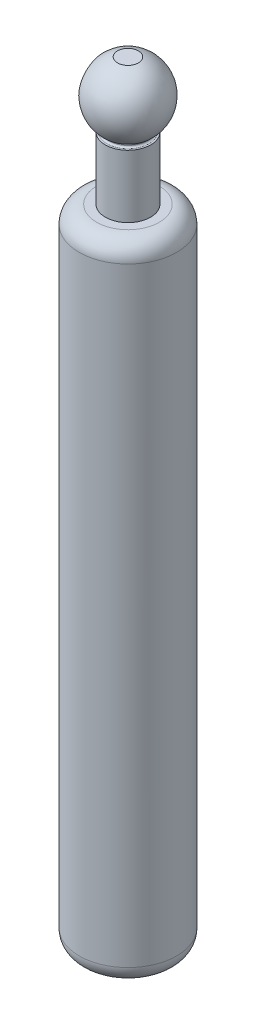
ISO-10303-21;
HEADER;
FILE_DESCRIPTION(('STEP AP214'),'2;1');
FILE_NAME('part.step','',(''),(''),'','','');
FILE_SCHEMA(('AUTOMOTIVE_DESIGN { 1 0 10303 214 1 1 1 1 }'));
ENDSEC;
DATA;
#1=APPLICATION_CONTEXT('core data for automotive mechanical design processes');
#2=APPLICATION_PROTOCOL_DEFINITION('international standard','automotive_design',2000,#1);
#3=PRODUCT_CONTEXT('',#1,'mechanical');
#4=PRODUCT('Part','Part','',(#3));
#5=PRODUCT_RELATED_PRODUCT_CATEGORY('part','',(#4));
#6=PRODUCT_DEFINITION_FORMATION('','',#4);
#7=PRODUCT_DEFINITION_CONTEXT('part definition',#1,'design');
#8=PRODUCT_DEFINITION('design','',#6,#7);
#9=PRODUCT_DEFINITION_SHAPE('','',#8);
#10=(LENGTH_UNIT() NAMED_UNIT(*) SI_UNIT(.MILLI.,.METRE.));
#11=(NAMED_UNIT(*) PLANE_ANGLE_UNIT() SI_UNIT($,.RADIAN.));
#12=(NAMED_UNIT(*) SI_UNIT($,.STERADIAN.) SOLID_ANGLE_UNIT());
#13=UNCERTAINTY_MEASURE_WITH_UNIT(LENGTH_MEASURE(1.E-05),#10,'distance_accuracy_value','');
#14=(GEOMETRIC_REPRESENTATION_CONTEXT(3) GLOBAL_UNCERTAINTY_ASSIGNED_CONTEXT((#13)) GLOBAL_UNIT_ASSIGNED_CONTEXT((#10,
#11,#12)) REPRESENTATION_CONTEXT('',''));
#15=CARTESIAN_POINT('',(0.,0.,0.));
#16=DIRECTION('',(0.,0.,1.));
#17=DIRECTION('',(1.,0.,0.));
#18=AXIS2_PLACEMENT_3D('',#15,#16,#17);
#19=CARTESIAN_POINT('',(-2.,0.,0.));
#20=DIRECTION('',(-1.,0.,0.));
#21=DIRECTION('',(0.,0.,0.999999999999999));
#22=AXIS2_PLACEMENT_3D('',#19,#20,#21);
#23=PLANE('',#22);
#24=CARTESIAN_POINT('',(-2.,0.,0.));
#25=DIRECTION('',(-1.,0.,0.));
#26=DIRECTION('',(0.,0.,0.999999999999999));
#27=AXIS2_PLACEMENT_3D('',#24,#25,#26);
#28=CIRCLE('',#27,6.5);
#29=CARTESIAN_POINT('',(-2.,0.,6.5));
#30=VERTEX_POINT('',#29);
#31=EDGE_CURVE('E88',#30,#30,#28,.T.);
#32=ORIENTED_EDGE('',*,*,#31,.T.);
#33=EDGE_LOOP('',(#32));
#34=FACE_BOUND('',#33,.T.);
#35=CARTESIAN_POINT('',(-2.,0.,0.));
#36=DIRECTION('',(-1.,0.,0.));
#37=DIRECTION('',(0.,0.,0.999999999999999));
#38=AXIS2_PLACEMENT_3D('',#35,#36,#37);
#39=CIRCLE('',#38,6.18465843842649);
#40=CARTESIAN_POINT('',(-2.,0.,6.18465843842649));
#41=VERTEX_POINT('',#40);
#42=EDGE_CURVE('E52',#41,#41,#39,.F.);
#43=ORIENTED_EDGE('',*,*,#42,.T.);
#44=EDGE_LOOP('',(#43));
#45=FACE_BOUND('',#44,.T.);
#46=ADVANCED_FACE('F31',(#34,#45),#23,.T.);
#47=CARTESIAN_POINT('',(0.,0.,0.));
#48=DIRECTION('',(0.,0.999999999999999,0.));
#49=DIRECTION('',(0.999999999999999,0.,0.));
#50=AXIS2_PLACEMENT_3D('',#47,#48,#49);
#51=SPHERICAL_SURFACE('',#50,10.);
#52=CARTESIAN_POINT('',(-1.66533453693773E-13,-7.59934207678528,0.));
#53=DIRECTION('',(0.,0.999999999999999,0.));
#54=DIRECTION('',(0.,0.,1.));
#55=AXIS2_PLACEMENT_3D('',#52,#53,#54);
#56=CIRCLE('',#55,6.50000000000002);
#57=CARTESIAN_POINT('',(-1.65450986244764E-13,-7.59934207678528,6.50000000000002));
#58=VERTEX_POINT('',#57);
#59=EDGE_CURVE('E67',#58,#58,#56,.T.);
#60=ORIENTED_EDGE('',*,*,#59,.T.);
#61=EDGE_LOOP('',(#60));
#62=FACE_BOUND('',#61,.T.);
#63=CARTESIAN_POINT('',(1.66533453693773E-13,9.5393920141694,0.));
#64=DIRECTION('',(0.,0.999999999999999,0.));
#65=DIRECTION('',(0.,0.,1.));
#66=AXIS2_PLACEMENT_3D('',#63,#64,#65);
#67=CIRCLE('',#66,3.00000000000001);
#68=CARTESIAN_POINT('',(1.67033054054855E-13,9.5393920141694,3.00000000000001));
#69=VERTEX_POINT('',#68);
#70=EDGE_CURVE('E70',#69,#69,#67,.T.);
#71=ORIENTED_EDGE('',*,*,#70,.F.);
#72=EDGE_LOOP('',(#71));
#73=FACE_BOUND('',#72,.T.);
#74=CARTESIAN_POINT('',(-6.99999999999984,0.,0.));
#75=DIRECTION('',(-1.,0.,0.));
#76=DIRECTION('',(0.,0.,0.999999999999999));
#77=AXIS2_PLACEMENT_3D('',#74,#75,#76);
#78=CIRCLE('',#77,7.14142842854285);
#79=CARTESIAN_POINT('',(-6.99999999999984,0.,7.14142842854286));
#80=VERTEX_POINT('',#79);
#81=EDGE_CURVE('E85',#80,#80,#78,.F.);
#82=ORIENTED_EDGE('',*,*,#81,.T.);
#83=EDGE_LOOP('',(#82));
#84=FACE_BOUND('',#83,.T.);
#85=ADVANCED_FACE('F103',(#62,#73,#84),#51,.T.);
#86=CARTESIAN_POINT('',(-1.11022302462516E-13,88.2813261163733,0.));
#87=DIRECTION('',(0.,0.999999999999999,0.));
#88=DIRECTION('',(0.,0.,1.));
#89=AXIS2_PLACEMENT_3D('',#86,#87,#88);
#90=CYLINDRICAL_SURFACE('',#89,5.50000000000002);
#91=CARTESIAN_POINT('',(0.,-8.09934207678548,0.));
#92=DIRECTION('',(0.,0.999999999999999,0.));
#93=DIRECTION('',(0.,0.,1.));
#94=AXIS2_PLACEMENT_3D('',#91,#92,#93);
#95=CIRCLE('',#94,5.50000000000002);
#96=CARTESIAN_POINT('',(-1.12614275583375E-13,-8.09934207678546,5.49999999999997));
#97=VERTEX_POINT('',#96);
#98=EDGE_CURVE('E58',#97,#97,#95,.F.);
#99=CARTESIAN_POINT('',(0.,-8.59934207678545,0.));
#100=DIRECTION('',(0.,-0.999999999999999,0.));
#101=DIRECTION('',(0.,0.,-1.));
#102=AXIS2_PLACEMENT_3D('',#99,#100,#101);
#103=CIRCLE('',#102,5.50000000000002);
#104=CARTESIAN_POINT('',(-1.12627286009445E-13,-8.59934207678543,5.49999999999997));
#105=VERTEX_POINT('',#104);
#106=EDGE_CURVE('E61',#105,#105,#103,.F.);
#107=CARTESIAN_POINT('',(-1.12614275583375E-13,-8.09934207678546,5.49999999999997));
#108=CARTESIAN_POINT('',(-1.12614411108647E-13,-8.1045504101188,5.49999999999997));
#109=CARTESIAN_POINT('',(-1.12614546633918E-13,-8.10975874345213,5.49999999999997));
#110=CARTESIAN_POINT('',(-1.12614817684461E-13,-8.1201754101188,5.49999999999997));
#111=CARTESIAN_POINT('',(-1.12614953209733E-13,-8.12538374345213,5.49999999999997));
#112=CARTESIAN_POINT('',(-1.12615224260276E-13,-8.13580041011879,5.49999999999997));
#113=CARTESIAN_POINT('',(-1.12615359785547E-13,-8.14100874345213,5.49999999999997));
#114=CARTESIAN_POINT('',(-1.12615630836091E-13,-8.1514254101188,5.49999999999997));
#115=CARTESIAN_POINT('',(-1.12615766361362E-13,-8.15663374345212,5.49999999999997));
#116=CARTESIAN_POINT('',(-1.12616037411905E-13,-8.16705041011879,5.49999999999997));
#117=CARTESIAN_POINT('',(-1.12616172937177E-13,-8.17225874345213,5.49999999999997));
#118=CARTESIAN_POINT('',(-1.1261644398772E-13,-8.18267541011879,5.49999999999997));
#119=CARTESIAN_POINT('',(-1.12616579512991E-13,-8.18788374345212,5.49999999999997));
#120=CARTESIAN_POINT('',(-1.12616850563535E-13,-8.19830041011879,5.49999999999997));
#121=CARTESIAN_POINT('',(-1.12616986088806E-13,-8.20350874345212,5.49999999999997));
#122=CARTESIAN_POINT('',(-1.12617257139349E-13,-8.21392541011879,5.49999999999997));
#123=CARTESIAN_POINT('',(-1.12617392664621E-13,-8.21913374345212,5.49999999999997));
#124=CARTESIAN_POINT('',(-1.12617663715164E-13,-8.22955041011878,5.49999999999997));
#125=CARTESIAN_POINT('',(-1.12617799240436E-13,-8.23475874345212,5.49999999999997));
#126=CARTESIAN_POINT('',(-1.12618070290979E-13,-8.24517541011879,5.49999999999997));
#127=CARTESIAN_POINT('',(-1.1261820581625E-13,-8.25038374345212,5.49999999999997));
#128=CARTESIAN_POINT('',(-1.12618476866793E-13,-8.26080041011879,5.49999999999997));
#129=CARTESIAN_POINT('',(-1.12618612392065E-13,-8.26600874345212,5.49999999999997));
#130=CARTESIAN_POINT('',(-1.12618883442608E-13,-8.27642541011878,5.49999999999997));
#131=CARTESIAN_POINT('',(-1.1261901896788E-13,-8.28163374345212,5.49999999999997));
#132=CARTESIAN_POINT('',(-1.12619290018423E-13,-8.29205041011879,5.49999999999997));
#133=CARTESIAN_POINT('',(-1.12619425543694E-13,-8.29725874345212,5.49999999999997));
#134=CARTESIAN_POINT('',(-1.12619696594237E-13,-8.30767541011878,5.49999999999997));
#135=CARTESIAN_POINT('',(-1.12619832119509E-13,-8.31288374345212,5.49999999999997));
#136=CARTESIAN_POINT('',(-1.12620103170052E-13,-8.32330041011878,5.49999999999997));
#137=CARTESIAN_POINT('',(-1.12620238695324E-13,-8.32850874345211,5.49999999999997));
#138=CARTESIAN_POINT('',(-1.12620509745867E-13,-8.33892541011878,5.49999999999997));
#139=CARTESIAN_POINT('',(-1.12620645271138E-13,-8.34413374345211,5.49999999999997));
#140=CARTESIAN_POINT('',(-1.12620916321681E-13,-8.35455041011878,5.49999999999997));
#141=CARTESIAN_POINT('',(-1.12621051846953E-13,-8.35975874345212,5.49999999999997));
#142=CARTESIAN_POINT('',(-1.12621322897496E-13,-8.37017541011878,5.49999999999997));
#143=CARTESIAN_POINT('',(-1.12621458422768E-13,-8.37538374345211,5.49999999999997));
#144=CARTESIAN_POINT('',(-1.12621729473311E-13,-8.38580041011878,5.49999999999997));
#145=CARTESIAN_POINT('',(-1.12621864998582E-13,-8.39100874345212,5.49999999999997));
#146=CARTESIAN_POINT('',(-1.12622136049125E-13,-8.40142541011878,5.49999999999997));
#147=CARTESIAN_POINT('',(-1.12622271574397E-13,-8.40663374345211,5.49999999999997));
#148=CARTESIAN_POINT('',(-1.1262254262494E-13,-8.41705041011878,5.49999999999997));
#149=CARTESIAN_POINT('',(-1.12622678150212E-13,-8.42225874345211,5.49999999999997));
#150=CARTESIAN_POINT('',(-1.12622949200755E-13,-8.43267541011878,5.49999999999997));
#151=CARTESIAN_POINT('',(-1.12623084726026E-13,-8.43788374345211,5.49999999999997));
#152=CARTESIAN_POINT('',(-1.1262335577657E-13,-8.44830041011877,5.49999999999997));
#153=CARTESIAN_POINT('',(-1.12623491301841E-13,-8.45350874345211,5.49999999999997));
#154=CARTESIAN_POINT('',(-1.12623762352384E-13,-8.46392541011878,5.49999999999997));
#155=CARTESIAN_POINT('',(-1.12623897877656E-13,-8.46913374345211,5.49999999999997));
#156=CARTESIAN_POINT('',(-1.12624168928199E-13,-8.47955041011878,5.49999999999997));
#157=CARTESIAN_POINT('',(-1.1262430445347E-13,-8.48475874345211,5.49999999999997));
#158=CARTESIAN_POINT('',(-1.12624575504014E-13,-8.49517541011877,5.49999999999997));
#159=CARTESIAN_POINT('',(-1.12624711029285E-13,-8.50038374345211,5.49999999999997));
#160=CARTESIAN_POINT('',(-1.12624982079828E-13,-8.51080041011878,5.49999999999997));
#161=CARTESIAN_POINT('',(-1.126251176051E-13,-8.51600874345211,5.49999999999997));
#162=CARTESIAN_POINT('',(-1.12625388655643E-13,-8.52642541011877,5.49999999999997));
#163=CARTESIAN_POINT('',(-1.12625524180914E-13,-8.53163374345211,5.49999999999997));
#164=CARTESIAN_POINT('',(-1.12625795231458E-13,-8.54205041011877,5.49999999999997));
#165=CARTESIAN_POINT('',(-1.12625930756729E-13,-8.5472587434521,5.49999999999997));
#166=CARTESIAN_POINT('',(-1.12626201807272E-13,-8.55767541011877,5.49999999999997));
#167=CARTESIAN_POINT('',(-1.12626337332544E-13,-8.5628837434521,5.49999999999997));
#168=CARTESIAN_POINT('',(-1.12626608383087E-13,-8.57330041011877,5.49999999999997));
#169=CARTESIAN_POINT('',(-1.12626743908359E-13,-8.5785087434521,5.49999999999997));
#170=CARTESIAN_POINT('',(-1.12627014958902E-13,-8.58892541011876,5.49999999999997));
#171=CARTESIAN_POINT('',(-1.12627150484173E-13,-8.5941337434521,5.49999999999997));
#172=CARTESIAN_POINT('',(-1.12627286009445E-13,-8.59934207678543,5.49999999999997));
#173=B_SPLINE_CURVE_WITH_KNOTS('',3,(#107,#108,#109,#110,#111,#112,#113,#114,#115,#116,#117,
#118,#119,#120,#121,#122,#123,#124,#125,#126,#127,#128,#129,#130,#131,#132,#133,#134,#135,#136,
#137,#138,#139,#140,#141,#142,#143,#144,#145,#146,#147,#148,#149,#150,#151,#152,#153,#154,#155,
#156,#157,#158,#159,#160,#161,#162,#163,#164,#165,#166,#167,#168,#169,#170,#171,#172),
.UNSPECIFIED.,.F.,.F.,(4,2,2,2,2,2,2,2,2,2,2,2,2,2,2,2,2,2,2,2,2,2,2,2,2,2,2,2,2,2,2,2,4),(0.,
0.0156250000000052,0.0312499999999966,0.0468750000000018,0.0624999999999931,0.0781249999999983,
0.0937499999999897,0.109374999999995,0.124999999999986,0.140624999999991,0.156249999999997,
0.171874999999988,0.187499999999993,0.203124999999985,0.21874999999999,0.234374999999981,
0.249999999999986,0.265624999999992,0.281249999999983,0.296874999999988,0.312499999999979,
0.328124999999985,0.343749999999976,0.359374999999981,0.374999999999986,0.390624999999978,
0.406249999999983,0.421874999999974,0.43749999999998,0.453124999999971,0.468749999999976,
0.484374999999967,0.499999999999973),.UNSPECIFIED.);
#174=EDGE_CURVE('BSEAM33',#97,#105,#173,.T.);
#175=ORIENTED_EDGE('',*,*,#98,.T.);
#176=ORIENTED_EDGE('',*,*,#106,.T.);
#177=ORIENTED_EDGE('',*,*,#174,.T.);
#178=ORIENTED_EDGE('',*,*,#174,.F.);
#179=EDGE_LOOP('',(#175,#177,#176,#178));
#180=FACE_BOUND('',#179,.T.);
#181=ADVANCED_FACE('F33',(#180),#90,.T.);
#182=CARTESIAN_POINT('',(6.50000000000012,-7.59934207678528,-1.11022302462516E-13));
#183=DIRECTION('',(0.,0.999999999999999,0.));
#184=DIRECTION('',(0.,0.,1.));
#185=AXIS2_PLACEMENT_3D('',#182,#183,#184);
#186=PLANE('',#185);
#187=CARTESIAN_POINT('',(-1.66533453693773E-13,-7.59934207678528,0.));
#188=DIRECTION('',(0.,0.999999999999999,0.));
#189=DIRECTION('',(0.,0.,1.));
#190=AXIS2_PLACEMENT_3D('',#187,#188,#189);
#191=CIRCLE('',#190,6.00000000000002);
#192=CARTESIAN_POINT('',(-1.65534252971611E-13,-7.59934207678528,6.00000000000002));
#193=VERTEX_POINT('',#192);
#194=EDGE_CURVE('E64',#193,#193,#191,.T.);
#195=ORIENTED_EDGE('',*,*,#194,.T.);
#196=EDGE_LOOP('',(#195));
#197=FACE_BOUND('',#196,.T.);
#198=ORIENTED_EDGE('',*,*,#59,.F.);
#199=EDGE_LOOP('',(#198));
#200=FACE_BOUND('',#199,.T.);
#201=ADVANCED_FACE('F111',(#197,#200),#186,.F.);
#202=CARTESIAN_POINT('',(1.66533453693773E-13,9.5393920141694,0.));
#203=DIRECTION('',(0.,-0.999999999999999,0.));
#204=DIRECTION('',(0.,0.,-1.));
#205=AXIS2_PLACEMENT_3D('',#202,#203,#204);
#206=PLANE('',#205);
#207=ORIENTED_EDGE('',*,*,#70,.T.);
#208=EDGE_LOOP('',(#207));
#209=FACE_BOUND('',#208,.T.);
#210=ADVANCED_FACE('F117',(#209),#206,.F.);
#211=CARTESIAN_POINT('',(2.22044604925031E-13,-52.0993420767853,-1.56125112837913E-13));
#212=DIRECTION('',(0.,0.999999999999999,0.));
#213=DIRECTION('',(0.,0.,1.));
#214=AXIS2_PLACEMENT_3D('',#211,#212,#213);
#215=PLANE('',#214);
#216=CARTESIAN_POINT('',(2.22044604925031E-13,-52.0993420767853,-1.56125112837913E-13));
#217=DIRECTION('',(0.,0.999999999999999,0.));
#218=DIRECTION('',(0.,0.,1.));
#219=AXIS2_PLACEMENT_3D('',#216,#217,#218);
#220=CIRCLE('',#219,7.00000000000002);
#221=CARTESIAN_POINT('',(-1.13509392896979E-13,-52.0993420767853,6.99999999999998));
#222=VERTEX_POINT('',#221);
#223=EDGE_CURVE('E73',#222,#222,#220,.T.);
#224=ORIENTED_EDGE('',*,*,#223,.F.);
#225=EDGE_LOOP('',(#224));
#226=FACE_BOUND('',#225,.T.);
#227=ADVANCED_FACE('F124',(#226),#215,.F.);
#228=CARTESIAN_POINT('',(-1.11022302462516E-13,88.2813261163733,0.));
#229=DIRECTION('',(0.,0.999999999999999,0.));
#230=DIRECTION('',(0.,0.,1.));
#231=AXIS2_PLACEMENT_3D('',#228,#229,#230);
#232=CYLINDRICAL_SURFACE('',#231,7.00000000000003);
#233=CARTESIAN_POINT('',(2.22044604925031E-13,-212.099342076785,-1.73472347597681E-13));
#234=DIRECTION('',(0.,0.999999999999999,0.));
#235=DIRECTION('',(0.,0.,1.));
#236=AXIS2_PLACEMENT_3D('',#233,#234,#235);
#237=CIRCLE('',#236,7.00000000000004);
#238=CARTESIAN_POINT('',(-1.17672729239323E-13,-212.099342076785,6.99999999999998));
#239=VERTEX_POINT('',#238);
#240=EDGE_CURVE('E76',#239,#239,#237,.T.);
#241=CARTESIAN_POINT('',(-1.17672729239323E-13,-212.099342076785,6.99999999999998));
#242=CARTESIAN_POINT('',(-1.17629361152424E-13,-210.432675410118,6.99999999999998));
#243=CARTESIAN_POINT('',(-1.17585993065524E-13,-208.766008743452,6.99999999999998));
#244=CARTESIAN_POINT('',(-1.17499256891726E-13,-205.432675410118,6.99999999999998));
#245=CARTESIAN_POINT('',(-1.17455888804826E-13,-203.766008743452,6.99999999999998));
#246=CARTESIAN_POINT('',(-1.17369152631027E-13,-200.432675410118,6.99999999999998));
#247=CARTESIAN_POINT('',(-1.17325784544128E-13,-198.766008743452,6.99999999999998));
#248=CARTESIAN_POINT('',(-1.17239048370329E-13,-195.432675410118,6.99999999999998));
#249=CARTESIAN_POINT('',(-1.1719568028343E-13,-193.766008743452,6.99999999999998));
#250=CARTESIAN_POINT('',(-1.17108944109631E-13,-190.432675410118,6.99999999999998));
#251=CARTESIAN_POINT('',(-1.17065576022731E-13,-188.766008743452,6.99999999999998));
#252=CARTESIAN_POINT('',(-1.16978839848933E-13,-185.432675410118,6.99999999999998));
#253=CARTESIAN_POINT('',(-1.16935471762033E-13,-183.766008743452,6.99999999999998));
#254=CARTESIAN_POINT('',(-1.16848735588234E-13,-180.432675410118,6.99999999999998));
#255=CARTESIAN_POINT('',(-1.16805367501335E-13,-178.766008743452,6.99999999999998));
#256=CARTESIAN_POINT('',(-1.16718631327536E-13,-175.432675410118,6.99999999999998));
#257=CARTESIAN_POINT('',(-1.16675263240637E-13,-173.766008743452,6.99999999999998));
#258=CARTESIAN_POINT('',(-1.16588527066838E-13,-170.432675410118,6.99999999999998));
#259=CARTESIAN_POINT('',(-1.16545158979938E-13,-168.766008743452,6.99999999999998));
#260=CARTESIAN_POINT('',(-1.1645842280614E-13,-165.432675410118,6.99999999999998));
#261=CARTESIAN_POINT('',(-1.1641505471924E-13,-163.766008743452,6.99999999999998));
#262=CARTESIAN_POINT('',(-1.16328318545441E-13,-160.432675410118,6.99999999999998));
#263=CARTESIAN_POINT('',(-1.16284950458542E-13,-158.766008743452,6.99999999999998));
#264=CARTESIAN_POINT('',(-1.16198214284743E-13,-155.432675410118,6.99999999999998));
#265=CARTESIAN_POINT('',(-1.16154846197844E-13,-153.766008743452,6.99999999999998));
#266=CARTESIAN_POINT('',(-1.16068110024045E-13,-150.432675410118,6.99999999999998));
#267=CARTESIAN_POINT('',(-1.16024741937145E-13,-148.766008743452,6.99999999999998));
#268=CARTESIAN_POINT('',(-1.15938005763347E-13,-145.432675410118,6.99999999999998));
#269=CARTESIAN_POINT('',(-1.15894637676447E-13,-143.766008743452,6.99999999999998));
#270=CARTESIAN_POINT('',(-1.15807901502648E-13,-140.432675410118,6.99999999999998));
#271=CARTESIAN_POINT('',(-1.15764533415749E-13,-138.766008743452,6.99999999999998));
#272=CARTESIAN_POINT('',(-1.1567779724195E-13,-135.432675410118,6.99999999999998));
#273=CARTESIAN_POINT('',(-1.15634429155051E-13,-133.766008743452,6.99999999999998));
#274=CARTESIAN_POINT('',(-1.15547692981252E-13,-130.432675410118,6.99999999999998));
#275=CARTESIAN_POINT('',(-1.15504324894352E-13,-128.766008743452,6.99999999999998));
#276=CARTESIAN_POINT('',(-1.15417588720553E-13,-125.432675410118,6.99999999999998));
#277=CARTESIAN_POINT('',(-1.15374220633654E-13,-123.766008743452,6.99999999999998));
#278=CARTESIAN_POINT('',(-1.15287484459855E-13,-120.432675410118,6.99999999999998));
#279=CARTESIAN_POINT('',(-1.15244116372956E-13,-118.766008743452,6.99999999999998));
#280=CARTESIAN_POINT('',(-1.15157380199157E-13,-115.432675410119,6.99999999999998));
#281=CARTESIAN_POINT('',(-1.15114012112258E-13,-113.766008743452,6.99999999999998));
#282=CARTESIAN_POINT('',(-1.15027275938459E-13,-110.432675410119,6.99999999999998));
#283=CARTESIAN_POINT('',(-1.14983907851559E-13,-108.766008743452,6.99999999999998));
#284=CARTESIAN_POINT('',(-1.1489717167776E-13,-105.432675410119,6.99999999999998));
#285=CARTESIAN_POINT('',(-1.14853803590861E-13,-103.766008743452,6.99999999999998));
#286=CARTESIAN_POINT('',(-1.14767067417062E-13,-100.432675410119,6.99999999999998));
#287=CARTESIAN_POINT('',(-1.14723699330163E-13,-98.7660087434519,6.99999999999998));
#288=CARTESIAN_POINT('',(-1.14636963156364E-13,-95.4326754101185,6.99999999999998));
#289=CARTESIAN_POINT('',(-1.14593595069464E-13,-93.7660087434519,6.99999999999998));
#290=CARTESIAN_POINT('',(-1.14506858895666E-13,-90.4326754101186,6.99999999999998));
#291=CARTESIAN_POINT('',(-1.14463490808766E-13,-88.7660087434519,6.99999999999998));
#292=CARTESIAN_POINT('',(-1.14376754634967E-13,-85.4326754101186,6.99999999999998));
#293=CARTESIAN_POINT('',(-1.14333386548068E-13,-83.7660087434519,6.99999999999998));
#294=CARTESIAN_POINT('',(-1.14246650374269E-13,-80.4326754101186,6.99999999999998));
#295=CARTESIAN_POINT('',(-1.1420328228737E-13,-78.7660087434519,6.99999999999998));
#296=CARTESIAN_POINT('',(-1.14116546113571E-13,-75.4326754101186,6.99999999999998));
#297=CARTESIAN_POINT('',(-1.14073178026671E-13,-73.7660087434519,6.99999999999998));
#298=CARTESIAN_POINT('',(-1.13986441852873E-13,-70.4326754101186,6.99999999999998));
#299=CARTESIAN_POINT('',(-1.13943073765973E-13,-68.7660087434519,6.99999999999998));
#300=CARTESIAN_POINT('',(-1.13856337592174E-13,-65.4326754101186,6.99999999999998));
#301=CARTESIAN_POINT('',(-1.13812969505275E-13,-63.766008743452,6.99999999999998));
#302=CARTESIAN_POINT('',(-1.13726233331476E-13,-60.4326754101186,6.99999999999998));
#303=CARTESIAN_POINT('',(-1.13682865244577E-13,-58.766008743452,6.99999999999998));
#304=CARTESIAN_POINT('',(-1.13596129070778E-13,-55.4326754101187,6.99999999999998));
#305=CARTESIAN_POINT('',(-1.13552760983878E-13,-53.766008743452,6.99999999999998));
#306=CARTESIAN_POINT('',(-1.13509392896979E-13,-52.0993420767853,6.99999999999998));
#307=B_SPLINE_CURVE_WITH_KNOTS('',3,(#241,#242,#243,#244,#245,#246,#247,#248,#249,#250,#251,
#252,#253,#254,#255,#256,#257,#258,#259,#260,#261,#262,#263,#264,#265,#266,#267,#268,#269,#270,
#271,#272,#273,#274,#275,#276,#277,#278,#279,#280,#281,#282,#283,#284,#285,#286,#287,#288,#289,
#290,#291,#292,#293,#294,#295,#296,#297,#298,#299,#300,#301,#302,#303,#304,#305,#306),
.UNSPECIFIED.,.F.,.F.,(4,2,2,2,2,2,2,2,2,2,2,2,2,2,2,2,2,2,2,2,2,2,2,2,2,2,2,2,2,2,2,2,4),(0.,
5.,10.,15.,20.,25.,30.,35.,39.9999999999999,44.9999999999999,49.9999999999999,54.9999999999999,
59.9999999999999,64.9999999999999,69.9999999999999,74.9999999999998,79.9999999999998,
84.9999999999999,89.9999999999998,94.9999999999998,99.9999999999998,105.,110.,115.,120.,125.,
130.,135.,140.,145.,150.,155.,160.),.UNSPECIFIED.);
#308=EDGE_CURVE('BSEAM159',#239,#222,#307,.T.);
#309=ORIENTED_EDGE('',*,*,#240,.F.);
#310=ORIENTED_EDGE('',*,*,#223,.T.);
#311=ORIENTED_EDGE('',*,*,#308,.T.);
#312=ORIENTED_EDGE('',*,*,#308,.F.);
#313=EDGE_LOOP('',(#309,#311,#310,#312));
#314=FACE_BOUND('',#313,.T.);
#315=ADVANCED_FACE('F159',(#314),#232,.F.);
#316=CARTESIAN_POINT('',(14.0000000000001,-212.099342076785,0.));
#317=DIRECTION('',(0.,0.999999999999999,0.));
#318=DIRECTION('',(0.,0.,1.));
#319=AXIS2_PLACEMENT_3D('',#316,#317,#318);
#320=PLANE('',#319);
#321=CARTESIAN_POINT('',(2.22044604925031E-13,-212.099342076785,-1.73472347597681E-13));
#322=DIRECTION('',(0.,0.999999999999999,0.));
#323=DIRECTION('',(0.,0.,1.));
#324=AXIS2_PLACEMENT_3D('',#321,#322,#323);
#325=CIRCLE('',#324,9.00000000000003);
#326=CARTESIAN_POINT('',(2.23543406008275E-13,-212.099342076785,8.99999999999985));
#327=VERTEX_POINT('',#326);
#328=EDGE_CURVE('E10',#327,#327,#325,.F.);
#329=ORIENTED_EDGE('',*,*,#328,.T.);
#330=EDGE_LOOP('',(#329));
#331=FACE_BOUND('',#330,.T.);
#332=ORIENTED_EDGE('',*,*,#240,.T.);
#333=EDGE_LOOP('',(#332));
#334=FACE_BOUND('',#333,.T.);
#335=ADVANCED_FACE('F156',(#331,#334),#320,.F.);
#336=CARTESIAN_POINT('',(-1.11022302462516E-13,88.2813261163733,0.));
#337=DIRECTION('',(0.,0.999999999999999,0.));
#338=DIRECTION('',(0.,0.,1.));
#339=AXIS2_PLACEMENT_3D('',#336,#337,#338);
#340=CYLINDRICAL_SURFACE('',#339,14.);
#341=CARTESIAN_POINT('',(0.,-207.099342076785,0.));
#342=DIRECTION('',(0.,0.999999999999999,0.));
#343=DIRECTION('',(0.,0.,1.));
#344=AXIS2_PLACEMENT_3D('',#341,#342,#343);
#345=CIRCLE('',#344,14.);
#346=CARTESIAN_POINT('',(-1.16376890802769E-13,-207.099342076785,14.));
#347=VERTEX_POINT('',#346);
#348=EDGE_CURVE('E38',#347,#347,#345,.T.);
#349=CARTESIAN_POINT('',(2.22044604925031E-13,-32.0993420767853,0.));
#350=DIRECTION('',(0.,-0.999999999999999,0.));
#351=DIRECTION('',(0.,0.,-1.));
#352=AXIS2_PLACEMENT_3D('',#349,#350,#351);
#353=CIRCLE('',#352,14.);
#354=CARTESIAN_POINT('',(-1.1182324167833E-13,-32.0993420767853,14.));
#355=VERTEX_POINT('',#354);
#356=EDGE_CURVE('E42',#355,#355,#353,.T.);
#357=CARTESIAN_POINT('',(-1.16376890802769E-13,-207.099342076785,14.));
#358=CARTESIAN_POINT('',(-1.16329456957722E-13,-205.276425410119,14.));
#359=CARTESIAN_POINT('',(-1.16282023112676E-13,-203.453508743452,14.));
#360=CARTESIAN_POINT('',(-1.16187155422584E-13,-199.807675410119,14.));
#361=CARTESIAN_POINT('',(-1.16139721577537E-13,-197.984758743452,14.));
#362=CARTESIAN_POINT('',(-1.16044853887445E-13,-194.338925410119,14.));
#363=CARTESIAN_POINT('',(-1.15997420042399E-13,-192.516008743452,14.));
#364=CARTESIAN_POINT('',(-1.15902552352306E-13,-188.870175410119,14.));
#365=CARTESIAN_POINT('',(-1.1585511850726E-13,-187.047258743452,14.));
#366=CARTESIAN_POINT('',(-1.15760250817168E-13,-183.401425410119,14.));
#367=CARTESIAN_POINT('',(-1.15712816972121E-13,-181.578508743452,14.));
#368=CARTESIAN_POINT('',(-1.15617949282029E-13,-177.932675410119,14.));
#369=CARTESIAN_POINT('',(-1.15570515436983E-13,-176.109758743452,14.));
#370=CARTESIAN_POINT('',(-1.1547564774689E-13,-172.463925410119,14.));
#371=CARTESIAN_POINT('',(-1.15428213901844E-13,-170.641008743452,14.));
#372=CARTESIAN_POINT('',(-1.15333346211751E-13,-166.995175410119,14.));
#373=CARTESIAN_POINT('',(-1.15285912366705E-13,-165.172258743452,14.));
#374=CARTESIAN_POINT('',(-1.15191044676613E-13,-161.526425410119,14.));
#375=CARTESIAN_POINT('',(-1.15143610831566E-13,-159.703508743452,14.));
#376=CARTESIAN_POINT('',(-1.15048743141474E-13,-156.057675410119,14.));
#377=CARTESIAN_POINT('',(-1.15001309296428E-13,-154.234758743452,14.));
#378=CARTESIAN_POINT('',(-1.14906441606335E-13,-150.588925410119,14.));
#379=CARTESIAN_POINT('',(-1.14859007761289E-13,-148.766008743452,14.));
#380=CARTESIAN_POINT('',(-1.14764140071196E-13,-145.120175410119,14.));
#381=CARTESIAN_POINT('',(-1.1471670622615E-13,-143.297258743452,14.));
#382=CARTESIAN_POINT('',(-1.14621838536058E-13,-139.651425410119,14.));
#383=CARTESIAN_POINT('',(-1.14574404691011E-13,-137.828508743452,14.));
#384=CARTESIAN_POINT('',(-1.14479537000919E-13,-134.182675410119,14.));
#385=CARTESIAN_POINT('',(-1.14432103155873E-13,-132.359758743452,14.));
#386=CARTESIAN_POINT('',(-1.1433723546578E-13,-128.713925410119,14.));
#387=CARTESIAN_POINT('',(-1.14289801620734E-13,-126.891008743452,14.));
#388=CARTESIAN_POINT('',(-1.14194933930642E-13,-123.245175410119,14.));
#389=CARTESIAN_POINT('',(-1.14147500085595E-13,-121.422258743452,14.));
#390=CARTESIAN_POINT('',(-1.14052632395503E-13,-117.776425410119,14.));
#391=CARTESIAN_POINT('',(-1.14005198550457E-13,-115.953508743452,14.));
#392=CARTESIAN_POINT('',(-1.13910330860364E-13,-112.307675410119,14.));
#393=CARTESIAN_POINT('',(-1.13862897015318E-13,-110.484758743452,14.));
#394=CARTESIAN_POINT('',(-1.13768029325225E-13,-106.838925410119,14.));
#395=CARTESIAN_POINT('',(-1.13720595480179E-13,-105.016008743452,14.));
#396=CARTESIAN_POINT('',(-1.13625727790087E-13,-101.370175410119,14.));
#397=CARTESIAN_POINT('',(-1.1357829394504E-13,-99.5472587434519,14.));
#398=CARTESIAN_POINT('',(-1.13483426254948E-13,-95.9014254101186,14.));
#399=CARTESIAN_POINT('',(-1.13435992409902E-13,-94.0785087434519,14.));
#400=CARTESIAN_POINT('',(-1.13341124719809E-13,-90.4326754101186,14.));
#401=CARTESIAN_POINT('',(-1.13293690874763E-13,-88.6097587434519,14.));
#402=CARTESIAN_POINT('',(-1.13198823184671E-13,-84.9639254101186,14.));
#403=CARTESIAN_POINT('',(-1.13151389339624E-13,-83.1410087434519,14.));
#404=CARTESIAN_POINT('',(-1.13056521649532E-13,-79.4951754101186,14.));
#405=CARTESIAN_POINT('',(-1.13009087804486E-13,-77.6722587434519,14.));
#406=CARTESIAN_POINT('',(-1.12914220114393E-13,-74.0264254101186,14.));
#407=CARTESIAN_POINT('',(-1.12866786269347E-13,-72.2035087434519,14.));
#408=CARTESIAN_POINT('',(-1.12771918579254E-13,-68.5576754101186,14.));
#409=CARTESIAN_POINT('',(-1.12724484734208E-13,-66.7347587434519,14.));
#410=CARTESIAN_POINT('',(-1.12629617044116E-13,-63.0889254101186,14.));
#411=CARTESIAN_POINT('',(-1.12582183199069E-13,-61.2660087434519,14.));
#412=CARTESIAN_POINT('',(-1.12487315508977E-13,-57.6201754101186,14.));
#413=CARTESIAN_POINT('',(-1.12439881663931E-13,-55.7972587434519,14.));
#414=CARTESIAN_POINT('',(-1.12345013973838E-13,-52.1514254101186,14.));
#415=CARTESIAN_POINT('',(-1.12297580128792E-13,-50.3285087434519,14.));
#416=CARTESIAN_POINT('',(-1.12202712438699E-13,-46.6826754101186,14.));
#417=CARTESIAN_POINT('',(-1.12155278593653E-13,-44.8597587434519,14.));
#418=CARTESIAN_POINT('',(-1.12060410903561E-13,-41.2139254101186,14.));
#419=CARTESIAN_POINT('',(-1.12012977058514E-13,-39.3910087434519,14.));
#420=CARTESIAN_POINT('',(-1.11918109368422E-13,-35.7451754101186,14.));
#421=CARTESIAN_POINT('',(-1.11870675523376E-13,-33.9222587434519,14.));
#422=CARTESIAN_POINT('',(-1.1182324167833E-13,-32.0993420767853,14.));
#423=B_SPLINE_CURVE_WITH_KNOTS('',3,(#357,#358,#359,#360,#361,#362,#363,#364,#365,#366,#367,
#368,#369,#370,#371,#372,#373,#374,#375,#376,#377,#378,#379,#380,#381,#382,#383,#384,#385,#386,
#387,#388,#389,#390,#391,#392,#393,#394,#395,#396,#397,#398,#399,#400,#401,#402,#403,#404,#405,
#406,#407,#408,#409,#410,#411,#412,#413,#414,#415,#416,#417,#418,#419,#420,#421,#422),
.UNSPECIFIED.,.F.,.F.,(4,2,2,2,2,2,2,2,2,2,2,2,2,2,2,2,2,2,2,2,2,2,2,2,2,2,2,2,2,2,2,2,4),(0.,
5.46875000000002,10.9375,16.40625,21.875,27.34375,32.8125,38.28125,43.75,49.21875,54.6875,
60.15625,65.625,71.09375,76.5625,82.03125,87.5,92.96875,98.4375,103.90625,109.375,114.84375,
120.3125,125.78125,131.25,136.71875,142.1875,147.65625,153.125,158.59375,164.0625,169.53125,
175.),.UNSPECIFIED.);
#424=EDGE_CURVE('BSEAM152',#347,#355,#423,.T.);
#425=ORIENTED_EDGE('',*,*,#348,.T.);
#426=ORIENTED_EDGE('',*,*,#356,.T.);
#427=ORIENTED_EDGE('',*,*,#424,.T.);
#428=ORIENTED_EDGE('',*,*,#424,.F.);
#429=EDGE_LOOP('',(#425,#427,#426,#428));
#430=FACE_BOUND('',#429,.T.);
#431=ADVANCED_FACE('F152',(#430),#340,.T.);
#432=CARTESIAN_POINT('',(6.50000000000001,-27.0993420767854,-1.66533453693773E-13));
#433=DIRECTION('',(0.,-0.999999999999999,0.));
#434=DIRECTION('',(0.,0.,-1.));
#435=AXIS2_PLACEMENT_3D('',#432,#433,#434);
#436=PLANE('',#435);
#437=CARTESIAN_POINT('',(0.,-27.0993420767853,0.));
#438=DIRECTION('',(0.,-0.999999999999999,0.));
#439=DIRECTION('',(0.,0.,-1.));
#440=AXIS2_PLACEMENT_3D('',#437,#438,#439);
#441=CIRCLE('',#440,9.00000000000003);
#442=CARTESIAN_POINT('',(0.,-27.0993420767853,-9.00000000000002));
#443=VERTEX_POINT('',#442);
#444=EDGE_CURVE('E46',#443,#443,#441,.F.);
#445=ORIENTED_EDGE('',*,*,#444,.T.);
#446=EDGE_LOOP('',(#445));
#447=FACE_BOUND('',#446,.T.);
#448=CARTESIAN_POINT('',(0.,-27.0993420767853,0.));
#449=DIRECTION('',(0.,0.999999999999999,0.));
#450=DIRECTION('',(0.,0.,1.));
#451=AXIS2_PLACEMENT_3D('',#448,#449,#450);
#452=CIRCLE('',#451,6.50000000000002);
#453=CARTESIAN_POINT('',(-1.12942138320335E-13,-27.0993420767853,6.49999999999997));
#454=VERTEX_POINT('',#453);
#455=EDGE_CURVE('E79',#454,#454,#452,.T.);
#456=ORIENTED_EDGE('',*,*,#455,.F.);
#457=EDGE_LOOP('',(#456));
#458=FACE_BOUND('',#457,.T.);
#459=ADVANCED_FACE('F148',(#447,#458),#436,.F.);
#460=CARTESIAN_POINT('',(-1.11022302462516E-13,88.2813261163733,0.));
#461=DIRECTION('',(0.,0.999999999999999,0.));
#462=DIRECTION('',(0.,0.,1.));
#463=AXIS2_PLACEMENT_3D('',#460,#461,#462);
#464=CYLINDRICAL_SURFACE('',#463,6.50000000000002);
#465=CARTESIAN_POINT('',(0.,-9.09934207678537,0.));
#466=DIRECTION('',(0.,0.999999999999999,0.));
#467=DIRECTION('',(0.,0.,1.));
#468=AXIS2_PLACEMENT_3D('',#465,#466,#467);
#469=CIRCLE('',#468,6.50000000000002);
#470=CARTESIAN_POINT('',(-1.12473762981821E-13,-9.09934207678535,6.49999999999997));
#471=VERTEX_POINT('',#470);
#472=EDGE_CURVE('E82',#471,#471,#469,.T.);
#473=CARTESIAN_POINT('',(-1.12473762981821E-13,-9.09934207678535,6.49999999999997));
#474=CARTESIAN_POINT('',(-1.12478641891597E-13,-9.28684207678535,6.49999999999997));
#475=CARTESIAN_POINT('',(-1.12483520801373E-13,-9.47434207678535,6.49999999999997));
#476=CARTESIAN_POINT('',(-1.12493278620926E-13,-9.84934207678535,6.49999999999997));
#477=CARTESIAN_POINT('',(-1.12498157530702E-13,-10.0368420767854,6.49999999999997));
#478=CARTESIAN_POINT('',(-1.12507915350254E-13,-10.4118420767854,6.49999999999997));
#479=CARTESIAN_POINT('',(-1.1251279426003E-13,-10.5993420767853,6.49999999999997));
#480=CARTESIAN_POINT('',(-1.12522552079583E-13,-10.9743420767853,6.49999999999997));
#481=CARTESIAN_POINT('',(-1.12527430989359E-13,-11.1618420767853,6.49999999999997));
#482=CARTESIAN_POINT('',(-1.12537188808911E-13,-11.5368420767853,6.49999999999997));
#483=CARTESIAN_POINT('',(-1.12542067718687E-13,-11.7243420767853,6.49999999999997));
#484=CARTESIAN_POINT('',(-1.1255182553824E-13,-12.0993420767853,6.49999999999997));
#485=CARTESIAN_POINT('',(-1.12556704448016E-13,-12.2868420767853,6.49999999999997));
#486=CARTESIAN_POINT('',(-1.12566462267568E-13,-12.6618420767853,6.49999999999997));
#487=CARTESIAN_POINT('',(-1.12571341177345E-13,-12.8493420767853,6.49999999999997));
#488=CARTESIAN_POINT('',(-1.12581098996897E-13,-13.2243420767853,6.49999999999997));
#489=CARTESIAN_POINT('',(-1.12585977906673E-13,-13.4118420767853,6.49999999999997));
#490=CARTESIAN_POINT('',(-1.12595735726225E-13,-13.7868420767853,6.49999999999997));
#491=CARTESIAN_POINT('',(-1.12600614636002E-13,-13.9743420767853,6.49999999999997));
#492=CARTESIAN_POINT('',(-1.12610372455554E-13,-14.3493420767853,6.49999999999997));
#493=CARTESIAN_POINT('',(-1.1261525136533E-13,-14.5368420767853,6.49999999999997));
#494=CARTESIAN_POINT('',(-1.12625009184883E-13,-14.9118420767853,6.49999999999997));
#495=CARTESIAN_POINT('',(-1.12629888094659E-13,-15.0993420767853,6.49999999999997));
#496=CARTESIAN_POINT('',(-1.12639645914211E-13,-15.4743420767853,6.49999999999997));
#497=CARTESIAN_POINT('',(-1.12644524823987E-13,-15.6618420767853,6.49999999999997));
#498=CARTESIAN_POINT('',(-1.1265428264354E-13,-16.0368420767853,6.49999999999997));
#499=CARTESIAN_POINT('',(-1.12659161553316E-13,-16.2243420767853,6.49999999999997));
#500=CARTESIAN_POINT('',(-1.12668919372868E-13,-16.5993420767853,6.49999999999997));
#501=CARTESIAN_POINT('',(-1.12673798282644E-13,-16.7868420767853,6.49999999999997));
#502=CARTESIAN_POINT('',(-1.12683556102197E-13,-17.1618420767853,6.49999999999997));
#503=CARTESIAN_POINT('',(-1.12688435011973E-13,-17.3493420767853,6.49999999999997));
#504=CARTESIAN_POINT('',(-1.12698192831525E-13,-17.7243420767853,6.49999999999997));
#505=CARTESIAN_POINT('',(-1.12703071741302E-13,-17.9118420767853,6.49999999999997));
#506=CARTESIAN_POINT('',(-1.12712829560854E-13,-18.2868420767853,6.49999999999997));
#507=CARTESIAN_POINT('',(-1.1271770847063E-13,-18.4743420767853,6.49999999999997));
#508=CARTESIAN_POINT('',(-1.12727466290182E-13,-18.8493420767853,6.49999999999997));
#509=CARTESIAN_POINT('',(-1.12732345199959E-13,-19.0368420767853,6.49999999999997));
#510=CARTESIAN_POINT('',(-1.12742103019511E-13,-19.4118420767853,6.49999999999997));
#511=CARTESIAN_POINT('',(-1.12746981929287E-13,-19.5993420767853,6.49999999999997));
#512=CARTESIAN_POINT('',(-1.1275673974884E-13,-19.9743420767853,6.49999999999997));
#513=CARTESIAN_POINT('',(-1.12761618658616E-13,-20.1618420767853,6.49999999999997));
#514=CARTESIAN_POINT('',(-1.12771376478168E-13,-20.5368420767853,6.49999999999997));
#515=CARTESIAN_POINT('',(-1.12776255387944E-13,-20.7243420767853,6.49999999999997));
#516=CARTESIAN_POINT('',(-1.12786013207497E-13,-21.0993420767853,6.49999999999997));
#517=CARTESIAN_POINT('',(-1.12790892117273E-13,-21.2868420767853,6.49999999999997));
#518=CARTESIAN_POINT('',(-1.12800649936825E-13,-21.6618420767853,6.49999999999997));
#519=CARTESIAN_POINT('',(-1.12805528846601E-13,-21.8493420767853,6.49999999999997));
#520=CARTESIAN_POINT('',(-1.12815286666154E-13,-22.2243420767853,6.49999999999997));
#521=CARTESIAN_POINT('',(-1.1282016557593E-13,-22.4118420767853,6.49999999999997));
#522=CARTESIAN_POINT('',(-1.12829923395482E-13,-22.7868420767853,6.49999999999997));
#523=CARTESIAN_POINT('',(-1.12834802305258E-13,-22.9743420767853,6.49999999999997));
#524=CARTESIAN_POINT('',(-1.12844560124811E-13,-23.3493420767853,6.49999999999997));
#525=CARTESIAN_POINT('',(-1.12849439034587E-13,-23.5368420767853,6.49999999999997));
#526=CARTESIAN_POINT('',(-1.12859196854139E-13,-23.9118420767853,6.49999999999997));
#527=CARTESIAN_POINT('',(-1.12864075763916E-13,-24.0993420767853,6.49999999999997));
#528=CARTESIAN_POINT('',(-1.12873833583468E-13,-24.4743420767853,6.49999999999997));
#529=CARTESIAN_POINT('',(-1.12878712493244E-13,-24.6618420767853,6.49999999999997));
#530=CARTESIAN_POINT('',(-1.12888470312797E-13,-25.0368420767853,6.49999999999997));
#531=CARTESIAN_POINT('',(-1.12893349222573E-13,-25.2243420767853,6.49999999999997));
#532=CARTESIAN_POINT('',(-1.12903107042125E-13,-25.5993420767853,6.49999999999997));
#533=CARTESIAN_POINT('',(-1.12907985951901E-13,-25.7868420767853,6.49999999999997));
#534=CARTESIAN_POINT('',(-1.12917743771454E-13,-26.1618420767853,6.49999999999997));
#535=CARTESIAN_POINT('',(-1.1292262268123E-13,-26.3493420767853,6.49999999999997));
#536=CARTESIAN_POINT('',(-1.12932380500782E-13,-26.7243420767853,6.49999999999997));
#537=CARTESIAN_POINT('',(-1.12937259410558E-13,-26.9118420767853,6.49999999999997));
#538=CARTESIAN_POINT('',(-1.12942138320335E-13,-27.0993420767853,6.49999999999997));
#539=B_SPLINE_CURVE_WITH_KNOTS('',3,(#473,#474,#475,#476,#477,#478,#479,#480,#481,#482,#483,
#484,#485,#486,#487,#488,#489,#490,#491,#492,#493,#494,#495,#496,#497,#498,#499,#500,#501,#502,
#503,#504,#505,#506,#507,#508,#509,#510,#511,#512,#513,#514,#515,#516,#517,#518,#519,#520,#521,
#522,#523,#524,#525,#526,#527,#528,#529,#530,#531,#532,#533,#534,#535,#536,#537,#538),
.UNSPECIFIED.,.F.,.F.,(4,2,2,2,2,2,2,2,2,2,2,2,2,2,2,2,2,2,2,2,2,2,2,2,2,2,2,2,2,2,2,2,4),(0.,
0.562499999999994,1.125,1.68749999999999,2.24999999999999,2.8125,3.37499999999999,
3.93749999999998,4.49999999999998,5.06249999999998,5.62499999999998,6.18749999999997,
6.74999999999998,7.31249999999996,7.87499999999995,8.43749999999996,8.99999999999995,
9.56249999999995,10.125,10.6874999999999,11.2499999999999,11.8124999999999,12.3749999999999,
12.9374999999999,13.4999999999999,14.0624999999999,14.6249999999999,15.1874999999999,
15.7499999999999,16.3124999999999,16.8749999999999,17.4374999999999,17.9999999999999),.UNSPECIFIED.);
#540=EDGE_CURVE('BSEAM141',#471,#454,#539,.T.);
#541=ORIENTED_EDGE('',*,*,#472,.F.);
#542=ORIENTED_EDGE('',*,*,#455,.T.);
#543=ORIENTED_EDGE('',*,*,#540,.T.);
#544=ORIENTED_EDGE('',*,*,#540,.F.);
#545=EDGE_LOOP('',(#541,#543,#542,#544));
#546=FACE_BOUND('',#545,.T.);
#547=ADVANCED_FACE('F141',(#546),#464,.T.);
#548=CARTESIAN_POINT('',(6.50000000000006,-9.09934207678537,0.));
#549=DIRECTION('',(0.,-0.999999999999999,0.));
#550=DIRECTION('',(0.,0.,-1.));
#551=AXIS2_PLACEMENT_3D('',#548,#549,#550);
#552=PLANE('',#551);
#553=CARTESIAN_POINT('',(0.,-9.09934207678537,0.));
#554=DIRECTION('',(0.,-0.999999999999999,0.));
#555=DIRECTION('',(0.,0.,-1.));
#556=AXIS2_PLACEMENT_3D('',#553,#554,#555);
#557=CIRCLE('',#556,6.00000000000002);
#558=CARTESIAN_POINT('',(0.,-9.09934207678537,-5.99999999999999));
#559=VERTEX_POINT('',#558);
#560=EDGE_CURVE('E51',#559,#559,#557,.T.);
#561=ORIENTED_EDGE('',*,*,#560,.T.);
#562=EDGE_LOOP('',(#561));
#563=FACE_BOUND('',#562,.T.);
#564=ORIENTED_EDGE('',*,*,#472,.T.);
#565=EDGE_LOOP('',(#564));
#566=FACE_BOUND('',#565,.T.);
#567=ADVANCED_FACE('F132',(#563,#566),#552,.F.);
#568=CARTESIAN_POINT('',(0.,-8.09934207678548,0.));
#569=DIRECTION('',(0.,0.999999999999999,0.));
#570=DIRECTION('',(0.,0.,1.));
#571=AXIS2_PLACEMENT_3D('',#568,#569,#570);
#572=TOROIDAL_SURFACE('',#571,6.00000000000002,0.5);
#573=ORIENTED_EDGE('',*,*,#98,.F.);
#574=EDGE_LOOP('',(#573));
#575=FACE_BOUND('',#574,.T.);
#576=ORIENTED_EDGE('',*,*,#194,.F.);
#577=EDGE_LOOP('',(#576));
#578=FACE_BOUND('',#577,.T.);
#579=ADVANCED_FACE('F130',(#575,#578),#572,.F.);
#580=CARTESIAN_POINT('',(0.,-8.59934207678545,0.));
#581=DIRECTION('',(0.,-0.999999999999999,0.));
#582=DIRECTION('',(0.,0.,-1.));
#583=AXIS2_PLACEMENT_3D('',#580,#581,#582);
#584=TOROIDAL_SURFACE('',#583,6.00000000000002,0.5);
#585=ORIENTED_EDGE('',*,*,#560,.F.);
#586=EDGE_LOOP('',(#585));
#587=FACE_BOUND('',#586,.T.);
#588=ORIENTED_EDGE('',*,*,#106,.F.);
#589=EDGE_LOOP('',(#588));
#590=FACE_BOUND('',#589,.T.);
#591=ADVANCED_FACE('F99',(#587,#590),#584,.F.);
#592=CARTESIAN_POINT('',(-7.00000000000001,9.54039201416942,-9.86494733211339));
#593=DIRECTION('',(-1.,0.,0.));
#594=DIRECTION('',(0.,0.,0.999999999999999));
#595=AXIS2_PLACEMENT_3D('',#592,#593,#594);
#596=PLANE('',#595);
#597=CARTESIAN_POINT('',(-6.99999999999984,0.,0.));
#598=DIRECTION('',(-1.,0.,0.));
#599=DIRECTION('',(0.,0.,0.999999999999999));
#600=AXIS2_PLACEMENT_3D('',#597,#598,#599);
#601=CIRCLE('',#600,6.5);
#602=CARTESIAN_POINT('',(-6.99999999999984,0.,6.5));
#603=VERTEX_POINT('',#602);
#604=EDGE_CURVE('E55',#603,#603,#601,.T.);
#605=ORIENTED_EDGE('',*,*,#604,.F.);
#606=EDGE_LOOP('',(#605));
#607=FACE_BOUND('',#606,.T.);
#608=ORIENTED_EDGE('',*,*,#81,.F.);
#609=EDGE_LOOP('',(#608));
#610=FACE_BOUND('',#609,.T.);
#611=ADVANCED_FACE('F96',(#607,#610),#596,.T.);
#612=CARTESIAN_POINT('',(-2.,0.,0.));
#613=DIRECTION('',(-1.,0.,0.));
#614=DIRECTION('',(0.,0.,0.999999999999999));
#615=AXIS2_PLACEMENT_3D('',#612,#613,#614);
#616=CYLINDRICAL_SURFACE('',#615,6.5);
#617=CARTESIAN_POINT('',(-2.,0.,6.5));
#618=CARTESIAN_POINT('',(-2.05208333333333,0.,6.5));
#619=CARTESIAN_POINT('',(-2.10416666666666,0.,6.5));
#620=CARTESIAN_POINT('',(-2.20833333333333,0.,6.5));
#621=CARTESIAN_POINT('',(-2.26041666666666,0.,6.5));
#622=CARTESIAN_POINT('',(-2.36458333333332,0.,6.5));
#623=CARTESIAN_POINT('',(-2.41666666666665,0.,6.5));
#624=CARTESIAN_POINT('',(-2.52083333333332,0.,6.5));
#625=CARTESIAN_POINT('',(-2.57291666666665,0.,6.5));
#626=CARTESIAN_POINT('',(-2.67708333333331,0.,6.5));
#627=CARTESIAN_POINT('',(-2.72916666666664,0.,6.5));
#628=CARTESIAN_POINT('',(-2.83333333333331,0.,6.5));
#629=CARTESIAN_POINT('',(-2.88541666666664,0.,6.5));
#630=CARTESIAN_POINT('',(-2.9895833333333,0.,6.5));
#631=CARTESIAN_POINT('',(-3.04166666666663,0.,6.5));
#632=CARTESIAN_POINT('',(-3.1458333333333,0.,6.5));
#633=CARTESIAN_POINT('',(-3.19791666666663,0.,6.5));
#634=CARTESIAN_POINT('',(-3.30208333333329,0.,6.5));
#635=CARTESIAN_POINT('',(-3.35416666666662,0.,6.5));
#636=CARTESIAN_POINT('',(-3.45833333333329,0.,6.5));
#637=CARTESIAN_POINT('',(-3.51041666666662,0.,6.5));
#638=CARTESIAN_POINT('',(-3.61458333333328,0.,6.5));
#639=CARTESIAN_POINT('',(-3.66666666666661,0.,6.5));
#640=CARTESIAN_POINT('',(-3.77083333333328,0.,6.5));
#641=CARTESIAN_POINT('',(-3.82291666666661,0.,6.5));
#642=CARTESIAN_POINT('',(-3.92708333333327,0.,6.5));
#643=CARTESIAN_POINT('',(-3.9791666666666,0.,6.5));
#644=CARTESIAN_POINT('',(-4.08333333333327,0.,6.5));
#645=CARTESIAN_POINT('',(-4.1354166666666,0.,6.5));
#646=CARTESIAN_POINT('',(-4.23958333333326,0.,6.5));
#647=CARTESIAN_POINT('',(-4.29166666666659,0.,6.5));
#648=CARTESIAN_POINT('',(-4.39583333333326,0.,6.5));
#649=CARTESIAN_POINT('',(-4.44791666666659,0.,6.5));
#650=CARTESIAN_POINT('',(-4.55208333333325,0.,6.5));
#651=CARTESIAN_POINT('',(-4.60416666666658,0.,6.5));
#652=CARTESIAN_POINT('',(-4.70833333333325,0.,6.5));
#653=CARTESIAN_POINT('',(-4.76041666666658,0.,6.5));
#654=CARTESIAN_POINT('',(-4.86458333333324,0.,6.5));
#655=CARTESIAN_POINT('',(-4.91666666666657,0.,6.5));
#656=CARTESIAN_POINT('',(-5.02083333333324,0.,6.5));
#657=CARTESIAN_POINT('',(-5.07291666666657,0.,6.5));
#658=CARTESIAN_POINT('',(-5.17708333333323,0.,6.5));
#659=CARTESIAN_POINT('',(-5.22916666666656,0.,6.5));
#660=CARTESIAN_POINT('',(-5.33333333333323,0.,6.5));
#661=CARTESIAN_POINT('',(-5.38541666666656,0.,6.5));
#662=CARTESIAN_POINT('',(-5.48958333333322,0.,6.5));
#663=CARTESIAN_POINT('',(-5.54166666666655,0.,6.5));
#664=CARTESIAN_POINT('',(-5.64583333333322,0.,6.5));
#665=CARTESIAN_POINT('',(-5.69791666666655,0.,6.5));
#666=CARTESIAN_POINT('',(-5.80208333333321,0.,6.5));
#667=CARTESIAN_POINT('',(-5.85416666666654,0.,6.5));
#668=CARTESIAN_POINT('',(-5.95833333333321,0.,6.5));
#669=CARTESIAN_POINT('',(-6.01041666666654,0.,6.5));
#670=CARTESIAN_POINT('',(-6.1145833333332,0.,6.5));
#671=CARTESIAN_POINT('',(-6.16666666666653,0.,6.5));
#672=CARTESIAN_POINT('',(-6.2708333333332,0.,6.5));
#673=CARTESIAN_POINT('',(-6.32291666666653,0.,6.5));
#674=CARTESIAN_POINT('',(-6.42708333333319,0.,6.5));
#675=CARTESIAN_POINT('',(-6.47916666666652,0.,6.5));
#676=CARTESIAN_POINT('',(-6.58333333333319,0.,6.5));
#677=CARTESIAN_POINT('',(-6.63541666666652,0.,6.5));
#678=CARTESIAN_POINT('',(-6.73958333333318,0.,6.5));
#679=CARTESIAN_POINT('',(-6.79166666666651,0.,6.5));
#680=CARTESIAN_POINT('',(-6.89583333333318,0.,6.5));
#681=CARTESIAN_POINT('',(-6.94791666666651,0.,6.5));
#682=CARTESIAN_POINT('',(-6.99999999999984,0.,6.5));
#683=B_SPLINE_CURVE_WITH_KNOTS('',3,(#617,#618,#619,#620,#621,#622,#623,#624,#625,#626,#627,
#628,#629,#630,#631,#632,#633,#634,#635,#636,#637,#638,#639,#640,#641,#642,#643,#644,#645,#646,
#647,#648,#649,#650,#651,#652,#653,#654,#655,#656,#657,#658,#659,#660,#661,#662,#663,#664,#665,
#666,#667,#668,#669,#670,#671,#672,#673,#674,#675,#676,#677,#678,#679,#680,#681,#682),
.UNSPECIFIED.,.F.,.F.,(4,2,2,2,2,2,2,2,2,2,2,2,2,2,2,2,2,2,2,2,2,2,2,2,2,2,2,2,2,2,2,2,4),(0.,
0.156249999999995,0.31249999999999,0.468749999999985,0.62499999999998,0.781249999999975,
0.93749999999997,1.09374999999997,1.24999999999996,1.40624999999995,1.56249999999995,
1.71874999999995,1.87499999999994,2.03124999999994,2.18749999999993,2.34374999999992,
2.49999999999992,2.65624999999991,2.81249999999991,2.9687499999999,3.1249999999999,
3.28124999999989,3.43749999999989,3.59374999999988,3.74999999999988,3.90624999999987,
4.06249999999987,4.21874999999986,4.37499999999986,4.53124999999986,4.68749999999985,
4.84374999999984,4.99999999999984),.UNSPECIFIED.);
#684=EDGE_CURVE('BSEAM94',#30,#603,#683,.T.);
#685=ORIENTED_EDGE('',*,*,#31,.F.);
#686=ORIENTED_EDGE('',*,*,#604,.T.);
#687=ORIENTED_EDGE('',*,*,#684,.T.);
#688=ORIENTED_EDGE('',*,*,#684,.F.);
#689=EDGE_LOOP('',(#685,#687,#686,#688));
#690=FACE_BOUND('',#689,.T.);
#691=ADVANCED_FACE('F94',(#690),#616,.F.);
#692=CARTESIAN_POINT('',(0.,0.,0.));
#693=DIRECTION('',(-1.,0.,0.));
#694=DIRECTION('',(0.,0.,-0.999999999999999));
#695=AXIS2_PLACEMENT_3D('',#692,#693,#694);
#696=SPHERICAL_SURFACE('',#695,6.5);
#697=ORIENTED_EDGE('',*,*,#42,.F.);
#698=EDGE_LOOP('',(#697));
#699=FACE_BOUND('',#698,.T.);
#700=ADVANCED_FACE('F215',(#699),#696,.F.);
#701=CARTESIAN_POINT('',(2.22044604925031E-13,-32.0993420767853,0.));
#702=DIRECTION('',(0.,-0.999999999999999,0.));
#703=DIRECTION('',(0.,0.,-1.));
#704=AXIS2_PLACEMENT_3D('',#701,#702,#703);
#705=TOROIDAL_SURFACE('',#704,9.00000000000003,5.);
#706=ORIENTED_EDGE('',*,*,#356,.F.);
#707=EDGE_LOOP('',(#706));
#708=FACE_BOUND('',#707,.T.);
#709=ORIENTED_EDGE('',*,*,#444,.F.);
#710=EDGE_LOOP('',(#709));
#711=FACE_BOUND('',#710,.T.);
#712=ADVANCED_FACE('F227',(#708,#711),#705,.T.);
#713=CARTESIAN_POINT('',(0.,-207.099342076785,0.));
#714=DIRECTION('',(0.,0.999999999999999,0.));
#715=DIRECTION('',(0.,0.,1.));
#716=AXIS2_PLACEMENT_3D('',#713,#714,#715);
#717=TOROIDAL_SURFACE('',#716,9.00000000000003,5.);
#718=ORIENTED_EDGE('',*,*,#328,.F.);
#719=EDGE_LOOP('',(#718));
#720=FACE_BOUND('',#719,.T.);
#721=ORIENTED_EDGE('',*,*,#348,.F.);
#722=EDGE_LOOP('',(#721));
#723=FACE_BOUND('',#722,.T.);
#724=ADVANCED_FACE('F235',(#720,#723),#717,.T.);
#725=CLOSED_SHELL('',(#46,#85,#181,#201,#210,#227,#315,#335,#431,#459,#547,#567,#579,#591,#611,
#691,#700,#712,#724));
#726=MANIFOLD_SOLID_BREP('B2',#725);
#727=ADVANCED_BREP_SHAPE_REPRESENTATION('',(#18,#726),#14);
#728=SHAPE_DEFINITION_REPRESENTATION(#9,#727);
ENDSEC;
END-ISO-10303-21;
